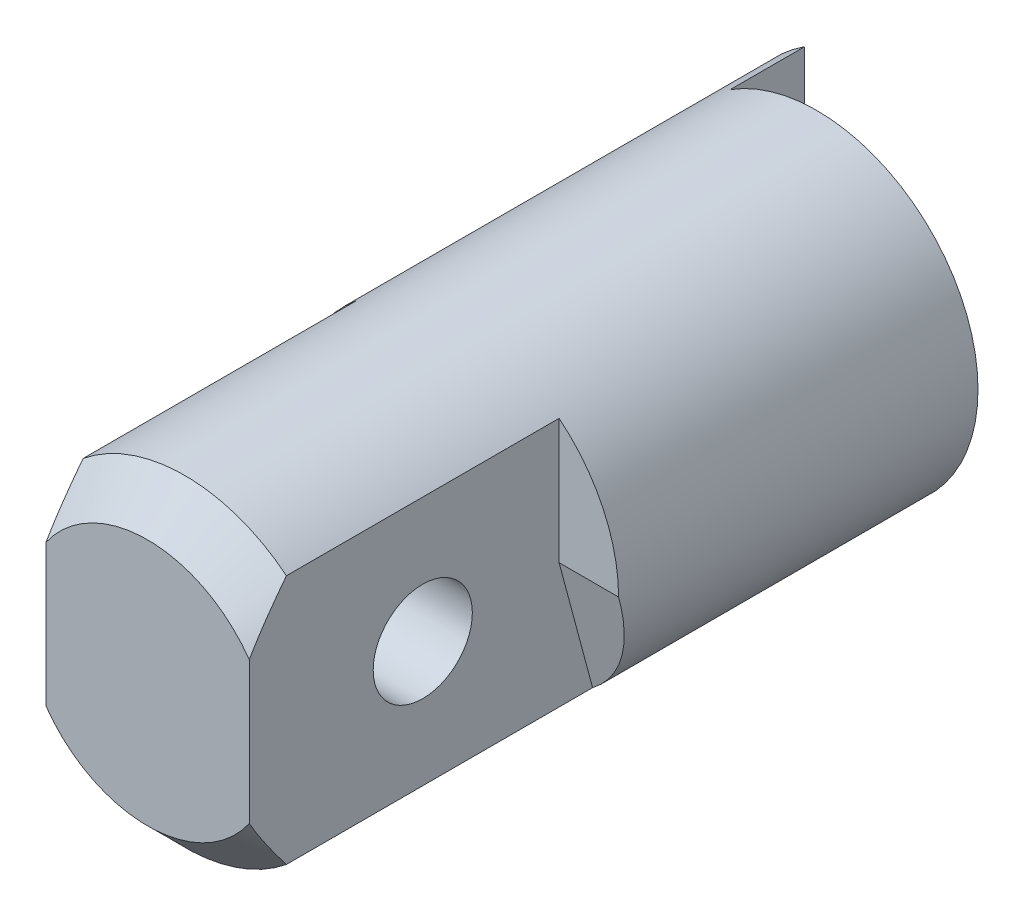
ISO-10303-21;
HEADER;
FILE_DESCRIPTION(('STEP AP214'),'2;1');
FILE_NAME('part.step','',(''),(''),'','','');
FILE_SCHEMA(('AUTOMOTIVE_DESIGN { 1 0 10303 214 1 1 1 1 }'));
ENDSEC;
DATA;
#1=APPLICATION_CONTEXT('core data for automotive mechanical design processes');
#2=APPLICATION_PROTOCOL_DEFINITION('international standard','automotive_design',2000,#1);
#3=PRODUCT_CONTEXT('',#1,'mechanical');
#4=PRODUCT('Part','Part','',(#3));
#5=PRODUCT_RELATED_PRODUCT_CATEGORY('part','',(#4));
#6=PRODUCT_DEFINITION_FORMATION('','',#4);
#7=PRODUCT_DEFINITION_CONTEXT('part definition',#1,'design');
#8=PRODUCT_DEFINITION('design','',#6,#7);
#9=PRODUCT_DEFINITION_SHAPE('','',#8);
#10=(LENGTH_UNIT() NAMED_UNIT(*) SI_UNIT(.MILLI.,.METRE.));
#11=(NAMED_UNIT(*) PLANE_ANGLE_UNIT() SI_UNIT($,.RADIAN.));
#12=(NAMED_UNIT(*) SI_UNIT($,.STERADIAN.) SOLID_ANGLE_UNIT());
#13=UNCERTAINTY_MEASURE_WITH_UNIT(LENGTH_MEASURE(1.E-05),#10,'distance_accuracy_value','');
#14=(GEOMETRIC_REPRESENTATION_CONTEXT(3) GLOBAL_UNCERTAINTY_ASSIGNED_CONTEXT((#13)) GLOBAL_UNIT_ASSIGNED_CONTEXT((#10,
#11,#12)) REPRESENTATION_CONTEXT('',''));
#15=CARTESIAN_POINT('',(0.,0.,0.));
#16=DIRECTION('',(0.,0.,1.));
#17=DIRECTION('',(1.,0.,0.));
#18=AXIS2_PLACEMENT_3D('',#15,#16,#17);
#19=CARTESIAN_POINT('',(0.,0.,-3.));
#20=DIRECTION('',(0.,0.,-1.));
#21=DIRECTION('',(-1.,0.,0.));
#22=AXIS2_PLACEMENT_3D('',#19,#20,#21);
#23=CYLINDRICAL_SURFACE('',#22,6.5);
#24=DIRECTION('',(0.,0.,-1.));
#25=VECTOR('',#24,1.);
#26=CARTESIAN_POINT('',(-4.1,5.0438080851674,-3.));
#27=LINE('',#26,#25);
#28=CARTESIAN_POINT('',(-4.1,5.0438080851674,14.5));
#29=VERTEX_POINT('',#28);
#30=CARTESIAN_POINT('',(-4.1,5.0438080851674,25.5));
#31=VERTEX_POINT('',#30);
#32=EDGE_CURVE('E145',#29,#31,#27,.F.);
#33=ORIENTED_EDGE('',*,*,#32,.T.);
#34=CARTESIAN_POINT('',(0.,0.,25.5));
#35=DIRECTION('',(0.,0.,-1.));
#36=DIRECTION('',(-1.,0.,0.));
#37=AXIS2_PLACEMENT_3D('',#34,#35,#36);
#38=CIRCLE('',#37,6.5);
#39=CARTESIAN_POINT('',(4.1,5.0438080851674,25.5));
#40=VERTEX_POINT('',#39);
#41=EDGE_CURVE('E176',#31,#40,#38,.T.);
#42=ORIENTED_EDGE('',*,*,#41,.T.);
#43=DIRECTION('',(0.,0.,-1.));
#44=VECTOR('',#43,1.);
#45=CARTESIAN_POINT('',(4.1,5.0438080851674,-3.));
#46=LINE('',#45,#44);
#47=CARTESIAN_POINT('',(4.1,5.0438080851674,14.5));
#48=VERTEX_POINT('',#47);
#49=EDGE_CURVE('E159',#40,#48,#46,.T.);
#50=ORIENTED_EDGE('',*,*,#49,.T.);
#51=CARTESIAN_POINT('',(0.,0.,14.5));
#52=DIRECTION('',(0.,0.,-1.));
#53=DIRECTION('',(-1.,0.,0.));
#54=AXIS2_PLACEMENT_3D('',#51,#52,#53);
#55=CIRCLE('',#54,6.5);
#56=CARTESIAN_POINT('',(6.5,0.,14.5));
#57=VERTEX_POINT('',#56);
#58=EDGE_CURVE('E164',#48,#57,#55,.T.);
#59=ORIENTED_EDGE('',*,*,#58,.T.);
#60=CARTESIAN_POINT('',(0.,0.,14.5));
#61=DIRECTION('',(0.,-0.258819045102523,0.965925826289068));
#62=DIRECTION('',(0.,-0.965925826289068,-0.258819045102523));
#63=AXIS2_PLACEMENT_3D('',#60,#61,#62);
#64=ELLIPSE('',#63,6.72929517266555,6.5);
#65=CARTESIAN_POINT('',(4.1,-5.0438080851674,13.1485156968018));
#66=VERTEX_POINT('',#65);
#67=EDGE_CURVE('E137',#66,#57,#64,.T.);
#68=ORIENTED_EDGE('',*,*,#67,.F.);
#69=DIRECTION('',(0.,0.,-1.));
#70=VECTOR('',#69,1.);
#71=CARTESIAN_POINT('',(4.1,-5.0438080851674,-3.));
#72=LINE('',#71,#70);
#73=CARTESIAN_POINT('',(4.1,-5.0438080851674,25.5));
#74=VERTEX_POINT('',#73);
#75=EDGE_CURVE('E156',#66,#74,#72,.F.);
#76=ORIENTED_EDGE('',*,*,#75,.T.);
#77=CARTESIAN_POINT('',(0.,0.,25.5));
#78=DIRECTION('',(0.,0.,-1.));
#79=DIRECTION('',(-1.,0.,0.));
#80=AXIS2_PLACEMENT_3D('',#77,#78,#79);
#81=CIRCLE('',#80,6.5);
#82=CARTESIAN_POINT('',(-4.1,-5.0438080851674,25.5));
#83=VERTEX_POINT('',#82);
#84=EDGE_CURVE('E173',#74,#83,#81,.T.);
#85=ORIENTED_EDGE('',*,*,#84,.T.);
#86=DIRECTION('',(0.,0.,-1.));
#87=VECTOR('',#86,1.);
#88=CARTESIAN_POINT('',(-4.1,-5.0438080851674,-3.));
#89=LINE('',#88,#87);
#90=CARTESIAN_POINT('',(-4.1,-5.0438080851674,13.1485156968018));
#91=VERTEX_POINT('',#90);
#92=EDGE_CURVE('E148',#83,#91,#89,.T.);
#93=ORIENTED_EDGE('',*,*,#92,.T.);
#94=CARTESIAN_POINT('',(0.,0.,14.5));
#95=DIRECTION('',(0.,-0.258819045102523,0.965925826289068));
#96=DIRECTION('',(0.,-0.965925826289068,-0.258819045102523));
#97=AXIS2_PLACEMENT_3D('',#94,#95,#96);
#98=ELLIPSE('',#97,6.72929517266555,6.5);
#99=CARTESIAN_POINT('',(-6.5,0.,14.5));
#100=VERTEX_POINT('',#99);
#101=EDGE_CURVE('E129',#100,#91,#98,.T.);
#102=ORIENTED_EDGE('',*,*,#101,.F.);
#103=CARTESIAN_POINT('',(0.,0.,14.5));
#104=DIRECTION('',(0.,0.,-1.));
#105=DIRECTION('',(-1.,0.,0.));
#106=AXIS2_PLACEMENT_3D('',#103,#104,#105);
#107=CIRCLE('',#106,6.5);
#108=EDGE_CURVE('E169',#100,#29,#107,.T.);
#109=ORIENTED_EDGE('',*,*,#108,.T.);
#110=EDGE_LOOP('',(#33,#42,#50,#59,#68,#76,#85,#93,#102,#109));
#111=FACE_BOUND('',#110,.T.);
#112=DIRECTION('',(0.,0.,-1.));
#113=VECTOR('',#112,1.);
#114=CARTESIAN_POINT('',(-3.5,-5.47722557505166,0.));
#115=LINE('',#114,#113);
#116=CARTESIAN_POINT('',(-3.5,-5.47722557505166,0.));
#117=VERTEX_POINT('',#116);
#118=CARTESIAN_POINT('',(-3.5,-5.47722557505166,-3.));
#119=VERTEX_POINT('',#118);
#120=EDGE_CURVE('E118',#117,#119,#115,.T.);
#121=ORIENTED_EDGE('',*,*,#120,.F.);
#122=CARTESIAN_POINT('',(0.,0.,0.));
#123=DIRECTION('',(0.,0.,-1.));
#124=DIRECTION('',(-1.,0.,0.));
#125=AXIS2_PLACEMENT_3D('',#122,#123,#124);
#126=CIRCLE('',#125,6.5);
#127=CARTESIAN_POINT('',(-3.5,5.47722557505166,0.));
#128=VERTEX_POINT('',#127);
#129=EDGE_CURVE('E113',#128,#117,#126,.T.);
#130=ORIENTED_EDGE('',*,*,#129,.F.);
#131=DIRECTION('',(0.,0.,-1.));
#132=VECTOR('',#131,1.);
#133=CARTESIAN_POINT('',(-3.5,5.47722557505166,0.));
#134=LINE('',#133,#132);
#135=CARTESIAN_POINT('',(-3.5,5.47722557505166,-3.));
#136=VERTEX_POINT('',#135);
#137=EDGE_CURVE('E119',#128,#136,#134,.T.);
#138=ORIENTED_EDGE('',*,*,#137,.T.);
#139=CARTESIAN_POINT('',(0.,0.,-3.));
#140=DIRECTION('',(0.,0.,-1.));
#141=DIRECTION('',(-1.,0.,0.));
#142=AXIS2_PLACEMENT_3D('',#139,#140,#141);
#143=CIRCLE('',#142,6.5);
#144=EDGE_CURVE('E161',#119,#136,#143,.T.);
#145=ORIENTED_EDGE('',*,*,#144,.F.);
#146=EDGE_LOOP('',(#121,#130,#138,#145));
#147=FACE_BOUND('',#146,.T.);
#148=ADVANCED_FACE('F14',(#111,#147),#23,.T.);
#149=CARTESIAN_POINT('',(6.5,0.,-3.));
#150=DIRECTION('',(0.,0.,1.));
#151=DIRECTION('',(1.,0.,0.));
#152=AXIS2_PLACEMENT_3D('',#149,#150,#151);
#153=PLANE('',#152);
#154=ORIENTED_EDGE('',*,*,#144,.T.);
#155=DIRECTION('',(0.,1.,0.));
#156=VECTOR('',#155,1.);
#157=CARTESIAN_POINT('',(-3.5,5.47722557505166,-3.));
#158=LINE('',#157,#156);
#159=EDGE_CURVE('E109',#119,#136,#158,.T.);
#160=ORIENTED_EDGE('',*,*,#159,.F.);
#161=EDGE_LOOP('',(#154,#160));
#162=FACE_BOUND('',#161,.T.);
#163=ADVANCED_FACE('F16',(#162),#153,.F.);
#164=CARTESIAN_POINT('',(-4.1,-10.,14.5));
#165=DIRECTION('',(0.,0.,-1.));
#166=DIRECTION('',(-1.,0.,0.));
#167=AXIS2_PLACEMENT_3D('',#164,#165,#166);
#168=PLANE('',#167);
#169=DIRECTION('',(1.,0.,0.));
#170=VECTOR('',#169,1.);
#171=CARTESIAN_POINT('',(-6.5,0.,14.5));
#172=LINE('',#171,#170);
#173=CARTESIAN_POINT('',(-4.1,0.,14.5));
#174=VERTEX_POINT('',#173);
#175=EDGE_CURVE('E126',#100,#174,#172,.T.);
#176=ORIENTED_EDGE('',*,*,#175,.T.);
#177=DIRECTION('',(0.,1.,0.));
#178=VECTOR('',#177,1.);
#179=CARTESIAN_POINT('',(-4.1,-10.,14.5));
#180=LINE('',#179,#178);
#181=EDGE_CURVE('E140',#174,#29,#180,.T.);
#182=ORIENTED_EDGE('',*,*,#181,.T.);
#183=ORIENTED_EDGE('',*,*,#108,.F.);
#184=EDGE_LOOP('',(#176,#182,#183));
#185=FACE_BOUND('',#184,.T.);
#186=ADVANCED_FACE('F210',(#185),#168,.F.);
#187=CARTESIAN_POINT('',(14.2470791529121,-10.,14.5));
#188=DIRECTION('',(0.,0.,-1.));
#189=DIRECTION('',(-1.,0.,0.));
#190=AXIS2_PLACEMENT_3D('',#187,#188,#189);
#191=PLANE('',#190);
#192=DIRECTION('',(-1.,0.,0.));
#193=VECTOR('',#192,1.);
#194=CARTESIAN_POINT('',(6.5,0.,14.5));
#195=LINE('',#194,#193);
#196=CARTESIAN_POINT('',(4.1,0.,14.5));
#197=VERTEX_POINT('',#196);
#198=EDGE_CURVE('E135',#57,#197,#195,.T.);
#199=ORIENTED_EDGE('',*,*,#198,.F.);
#200=ORIENTED_EDGE('',*,*,#58,.F.);
#201=DIRECTION('',(0.,1.,0.));
#202=VECTOR('',#201,1.);
#203=CARTESIAN_POINT('',(4.1,-10.,14.5));
#204=LINE('',#203,#202);
#205=EDGE_CURVE('E150',#197,#48,#204,.T.);
#206=ORIENTED_EDGE('',*,*,#205,.F.);
#207=EDGE_LOOP('',(#199,#200,#206));
#208=FACE_BOUND('',#207,.T.);
#209=ADVANCED_FACE('F205',(#208),#191,.F.);
#210=CARTESIAN_POINT('',(6.5,0.,27.));
#211=DIRECTION('',(0.,0.,-1.));
#212=DIRECTION('',(-1.,0.,0.));
#213=AXIS2_PLACEMENT_3D('',#210,#211,#212);
#214=PLANE('',#213);
#215=DIRECTION('',(0.,1.,0.));
#216=VECTOR('',#215,1.);
#217=CARTESIAN_POINT('',(4.1,-10.,27.));
#218=LINE('',#217,#216);
#219=CARTESIAN_POINT('',(4.1,-2.86181760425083,27.));
#220=VERTEX_POINT('',#219);
#221=CARTESIAN_POINT('',(4.1,2.86181760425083,27.));
#222=VERTEX_POINT('',#221);
#223=EDGE_CURVE('E151',#220,#222,#218,.T.);
#224=ORIENTED_EDGE('',*,*,#223,.T.);
#225=CARTESIAN_POINT('',(0.,0.,27.));
#226=DIRECTION('',(0.,0.,-1.));
#227=DIRECTION('',(-1.,0.,0.));
#228=AXIS2_PLACEMENT_3D('',#225,#226,#227);
#229=CIRCLE('',#228,5.);
#230=CARTESIAN_POINT('',(-4.1,2.86181760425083,27.));
#231=VERTEX_POINT('',#230);
#232=EDGE_CURVE('E35',#222,#231,#229,.F.);
#233=ORIENTED_EDGE('',*,*,#232,.T.);
#234=DIRECTION('',(0.,1.,0.));
#235=VECTOR('',#234,1.);
#236=CARTESIAN_POINT('',(-4.1,-10.,27.));
#237=LINE('',#236,#235);
#238=CARTESIAN_POINT('',(-4.1,-2.86181760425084,27.));
#239=VERTEX_POINT('',#238);
#240=EDGE_CURVE('E139',#239,#231,#237,.T.);
#241=ORIENTED_EDGE('',*,*,#240,.F.);
#242=CARTESIAN_POINT('',(0.,0.,27.));
#243=DIRECTION('',(0.,0.,-1.));
#244=DIRECTION('',(-1.,0.,0.));
#245=AXIS2_PLACEMENT_3D('',#242,#243,#244);
#246=CIRCLE('',#245,5.);
#247=EDGE_CURVE('E258',#239,#220,#246,.F.);
#248=ORIENTED_EDGE('',*,*,#247,.T.);
#249=EDGE_LOOP('',(#224,#233,#241,#248));
#250=FACE_BOUND('',#249,.T.);
#251=ADVANCED_FACE('F209',(#250),#214,.F.);
#252=CARTESIAN_POINT('',(-10.,0.,20.));
#253=DIRECTION('',(1.,0.,0.));
#254=DIRECTION('',(0.,0.,-1.));
#255=AXIS2_PLACEMENT_3D('',#252,#253,#254);
#256=CYLINDRICAL_SURFACE('',#255,2.);
#257=CARTESIAN_POINT('',(-4.1,0.,20.));
#258=DIRECTION('',(1.,0.,0.));
#259=DIRECTION('',(0.,0.,-1.));
#260=AXIS2_PLACEMENT_3D('',#257,#258,#259);
#261=CIRCLE('',#260,2.);
#262=CARTESIAN_POINT('',(-4.1,0.,18.));
#263=VERTEX_POINT('',#262);
#264=EDGE_CURVE('E143',#263,#263,#261,.F.);
#265=ORIENTED_EDGE('',*,*,#264,.T.);
#266=EDGE_LOOP('',(#265));
#267=FACE_BOUND('',#266,.T.);
#268=CARTESIAN_POINT('',(4.1,0.,20.));
#269=DIRECTION('',(-1.,0.,0.));
#270=DIRECTION('',(0.,0.,1.));
#271=AXIS2_PLACEMENT_3D('',#268,#269,#270);
#272=CIRCLE('',#271,2.);
#273=CARTESIAN_POINT('',(4.1,0.,22.));
#274=VERTEX_POINT('',#273);
#275=EDGE_CURVE('E153',#274,#274,#272,.F.);
#276=ORIENTED_EDGE('',*,*,#275,.T.);
#277=EDGE_LOOP('',(#276));
#278=FACE_BOUND('',#277,.T.);
#279=ADVANCED_FACE('F201',(#267,#278),#256,.F.);
#280=CARTESIAN_POINT('',(4.1,-10.,14.5));
#281=DIRECTION('',(-1.,0.,0.));
#282=DIRECTION('',(0.,0.,1.));
#283=AXIS2_PLACEMENT_3D('',#280,#281,#282);
#284=PLANE('',#283);
#285=ORIENTED_EDGE('',*,*,#275,.F.);
#286=EDGE_LOOP('',(#285));
#287=FACE_BOUND('',#286,.T.);
#288=ORIENTED_EDGE('',*,*,#49,.F.);
#289=CARTESIAN_POINT('',(4.1,5.0438080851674,25.5));
#290=CARTESIAN_POINT('',(4.1,4.95654758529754,25.5677086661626));
#291=CARTESIAN_POINT('',(4.1,4.86895267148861,25.6349843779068));
#292=CARTESIAN_POINT('',(4.1,4.69300619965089,25.7685455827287));
#293=CARTESIAN_POINT('',(4.1,4.60465461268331,25.8348310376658));
#294=CARTESIAN_POINT('',(4.1,4.33855611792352,26.0318501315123));
#295=CARTESIAN_POINT('',(4.1,4.15955657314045,26.1609095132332));
#296=CARTESIAN_POINT('',(4.1,3.8879115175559,26.3500749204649));
#297=CARTESIAN_POINT('',(4.1,3.79681450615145,26.4124085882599));
#298=CARTESIAN_POINT('',(4.1,3.61346203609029,26.5353428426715));
#299=CARTESIAN_POINT('',(4.1,3.52120663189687,26.5959435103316));
#300=CARTESIAN_POINT('',(4.1,3.33529470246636,26.7152019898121));
#301=CARTESIAN_POINT('',(4.1,3.24163669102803,26.773857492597));
#302=CARTESIAN_POINT('',(4.1,3.05285785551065,26.8887994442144));
#303=CARTESIAN_POINT('',(4.1,2.95773678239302,26.9450854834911));
#304=CARTESIAN_POINT('',(4.1,2.86181760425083,27.));
#305=B_SPLINE_CURVE_WITH_KNOTS('',3,(#289,#290,#291,#292,#293,#294,#295,#296,#297,#298,#299,
#300,#301,#302,#303,#304),.UNSPECIFIED.,.F.,.F.,(4,2,2,2,2,2,2,4),(0.,0.331340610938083,
0.662693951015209,1.32460586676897,1.65573602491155,1.98685067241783,2.31834524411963,
2.64989688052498),.UNSPECIFIED.);
#306=EDGE_CURVE('E187',#40,#222,#305,.T.);
#307=ORIENTED_EDGE('',*,*,#306,.T.);
#308=ORIENTED_EDGE('',*,*,#223,.F.);
#309=CARTESIAN_POINT('',(4.1,-2.86181760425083,27.));
#310=CARTESIAN_POINT('',(4.1,-2.95773678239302,26.9450854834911));
#311=CARTESIAN_POINT('',(4.1,-3.05285785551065,26.8887994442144));
#312=CARTESIAN_POINT('',(4.1,-3.24163669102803,26.773857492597));
#313=CARTESIAN_POINT('',(4.1,-3.33529470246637,26.7152019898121));
#314=CARTESIAN_POINT('',(4.1,-3.52120663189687,26.5959435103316));
#315=CARTESIAN_POINT('',(4.1,-3.61346203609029,26.5353428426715));
#316=CARTESIAN_POINT('',(4.1,-3.79681450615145,26.4124085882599));
#317=CARTESIAN_POINT('',(4.1,-3.8879115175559,26.3500749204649));
#318=CARTESIAN_POINT('',(4.1,-4.15955657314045,26.1609095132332));
#319=CARTESIAN_POINT('',(4.1,-4.33855611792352,26.0318501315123));
#320=CARTESIAN_POINT('',(4.1,-4.60465461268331,25.8348310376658));
#321=CARTESIAN_POINT('',(4.1,-4.69300619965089,25.7685455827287));
#322=CARTESIAN_POINT('',(4.1,-4.86895267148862,25.6349843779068));
#323=CARTESIAN_POINT('',(4.1,-4.95654758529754,25.5677086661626));
#324=CARTESIAN_POINT('',(4.1,-5.0438080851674,25.5));
#325=B_SPLINE_CURVE_WITH_KNOTS('',3,(#309,#310,#311,#312,#313,#314,#315,#316,#317,#318,#319,
#320,#321,#322,#323,#324),.UNSPECIFIED.,.F.,.F.,(4,2,2,2,2,2,2,4),(0.,0.331551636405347,
0.663046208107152,0.994160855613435,1.32529101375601,1.98720292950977,2.3185562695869,
2.64989688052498),.UNSPECIFIED.);
#326=EDGE_CURVE('E179',#220,#74,#325,.T.);
#327=ORIENTED_EDGE('',*,*,#326,.T.);
#328=ORIENTED_EDGE('',*,*,#75,.F.);
#329=DIRECTION('',(0.,0.965925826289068,0.258819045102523));
#330=VECTOR('',#329,1.);
#331=CARTESIAN_POINT('',(4.1,0.,14.5));
#332=LINE('',#331,#330);
#333=EDGE_CURVE('E132',#66,#197,#332,.T.);
#334=ORIENTED_EDGE('',*,*,#333,.T.);
#335=ORIENTED_EDGE('',*,*,#205,.T.);
#336=EDGE_LOOP('',(#288,#307,#308,#327,#328,#334,#335));
#337=FACE_BOUND('',#336,.T.);
#338=ADVANCED_FACE('F196',(#287,#337),#284,.F.);
#339=CARTESIAN_POINT('',(-4.1,-10.,14.5));
#340=DIRECTION('',(1.,0.,0.));
#341=DIRECTION('',(0.,0.,-1.));
#342=AXIS2_PLACEMENT_3D('',#339,#340,#341);
#343=PLANE('',#342);
#344=ORIENTED_EDGE('',*,*,#264,.F.);
#345=EDGE_LOOP('',(#344));
#346=FACE_BOUND('',#345,.T.);
#347=ORIENTED_EDGE('',*,*,#240,.T.);
#348=CARTESIAN_POINT('',(-4.1,2.86181760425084,27.));
#349=CARTESIAN_POINT('',(-4.1,2.95773678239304,26.9450854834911));
#350=CARTESIAN_POINT('',(-4.1,3.05285785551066,26.8887994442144));
#351=CARTESIAN_POINT('',(-4.1,3.24163669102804,26.7738574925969));
#352=CARTESIAN_POINT('',(-4.1,3.33529470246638,26.7152019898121));
#353=CARTESIAN_POINT('',(-4.1,3.52120663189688,26.5959435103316));
#354=CARTESIAN_POINT('',(-4.1,3.6134620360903,26.5353428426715));
#355=CARTESIAN_POINT('',(-4.1,3.79681450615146,26.4124085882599));
#356=CARTESIAN_POINT('',(-4.1,3.8879115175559,26.3500749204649));
#357=CARTESIAN_POINT('',(-4.1,4.15955657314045,26.1609095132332));
#358=CARTESIAN_POINT('',(-4.1,4.33855611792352,26.0318501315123));
#359=CARTESIAN_POINT('',(-4.1,4.60465461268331,25.8348310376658));
#360=CARTESIAN_POINT('',(-4.1,4.69300619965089,25.7685455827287));
#361=CARTESIAN_POINT('',(-4.1,4.86895267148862,25.6349843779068));
#362=CARTESIAN_POINT('',(-4.1,4.95654758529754,25.5677086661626));
#363=CARTESIAN_POINT('',(-4.1,5.0438080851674,25.5));
#364=B_SPLINE_CURVE_WITH_KNOTS('',3,(#348,#349,#350,#351,#352,#353,#354,#355,#356,#357,#358,
#359,#360,#361,#362,#363),.UNSPECIFIED.,.F.,.F.,(4,2,2,2,2,2,2,4),(0.,0.331551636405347,
0.663046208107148,0.994160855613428,1.325291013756,1.98720292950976,2.31855626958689,
2.64989688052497),.UNSPECIFIED.);
#365=EDGE_CURVE('E9',#231,#31,#364,.T.);
#366=ORIENTED_EDGE('',*,*,#365,.T.);
#367=ORIENTED_EDGE('',*,*,#32,.F.);
#368=ORIENTED_EDGE('',*,*,#181,.F.);
#369=DIRECTION('',(0.,-0.965925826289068,-0.258819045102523));
#370=VECTOR('',#369,1.);
#371=CARTESIAN_POINT('',(-4.1,0.,14.5));
#372=LINE('',#371,#370);
#373=EDGE_CURVE('E122',#174,#91,#372,.T.);
#374=ORIENTED_EDGE('',*,*,#373,.T.);
#375=ORIENTED_EDGE('',*,*,#92,.F.);
#376=CARTESIAN_POINT('',(-4.1,-5.0438080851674,25.5));
#377=CARTESIAN_POINT('',(-4.1,-4.95654758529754,25.5677086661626));
#378=CARTESIAN_POINT('',(-4.1,-4.86895267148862,25.6349843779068));
#379=CARTESIAN_POINT('',(-4.1,-4.69300619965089,25.7685455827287));
#380=CARTESIAN_POINT('',(-4.1,-4.60465461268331,25.8348310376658));
#381=CARTESIAN_POINT('',(-4.1,-4.33855611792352,26.0318501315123));
#382=CARTESIAN_POINT('',(-4.1,-4.15955657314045,26.1609095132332));
#383=CARTESIAN_POINT('',(-4.1,-3.8879115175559,26.3500749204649));
#384=CARTESIAN_POINT('',(-4.1,-3.79681450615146,26.4124085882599));
#385=CARTESIAN_POINT('',(-4.1,-3.6134620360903,26.5353428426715));
#386=CARTESIAN_POINT('',(-4.1,-3.52120663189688,26.5959435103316));
#387=CARTESIAN_POINT('',(-4.1,-3.33529470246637,26.7152019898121));
#388=CARTESIAN_POINT('',(-4.1,-3.24163669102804,26.773857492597));
#389=CARTESIAN_POINT('',(-4.1,-3.05285785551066,26.8887994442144));
#390=CARTESIAN_POINT('',(-4.1,-2.95773678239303,26.9450854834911));
#391=CARTESIAN_POINT('',(-4.1,-2.86181760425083,27.));
#392=B_SPLINE_CURVE_WITH_KNOTS('',3,(#376,#377,#378,#379,#380,#381,#382,#383,#384,#385,#386,
#387,#388,#389,#390,#391),.UNSPECIFIED.,.F.,.F.,(4,2,2,2,2,2,2,4),(0.,0.331340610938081,
0.662693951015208,1.32460586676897,1.65573602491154,1.98685067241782,2.31834524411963,
2.64989688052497),.UNSPECIFIED.);
#393=EDGE_CURVE('E28',#83,#239,#392,.T.);
#394=ORIENTED_EDGE('',*,*,#393,.T.);
#395=EDGE_LOOP('',(#347,#366,#367,#368,#374,#375,#394));
#396=FACE_BOUND('',#395,.T.);
#397=ADVANCED_FACE('F200',(#346,#396),#343,.F.);
#398=CARTESIAN_POINT('',(6.5,0.,14.5));
#399=DIRECTION('',(0.,-0.258819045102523,0.965925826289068));
#400=DIRECTION('',(0.,-0.965925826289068,-0.258819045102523));
#401=AXIS2_PLACEMENT_3D('',#398,#399,#400);
#402=PLANE('',#401);
#403=ORIENTED_EDGE('',*,*,#67,.T.);
#404=ORIENTED_EDGE('',*,*,#198,.T.);
#405=ORIENTED_EDGE('',*,*,#333,.F.);
#406=EDGE_LOOP('',(#403,#404,#405));
#407=FACE_BOUND('',#406,.T.);
#408=ADVANCED_FACE('F267',(#407),#402,.T.);
#409=CARTESIAN_POINT('',(-6.5,0.,14.5));
#410=DIRECTION('',(0.,-0.258819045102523,0.965925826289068));
#411=DIRECTION('',(0.,-0.965925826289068,-0.258819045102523));
#412=AXIS2_PLACEMENT_3D('',#409,#410,#411);
#413=PLANE('',#412);
#414=ORIENTED_EDGE('',*,*,#101,.T.);
#415=ORIENTED_EDGE('',*,*,#373,.F.);
#416=ORIENTED_EDGE('',*,*,#175,.F.);
#417=EDGE_LOOP('',(#414,#415,#416));
#418=FACE_BOUND('',#417,.T.);
#419=ADVANCED_FACE('F253',(#418),#413,.T.);
#420=CARTESIAN_POINT('',(0.,0.,25.5));
#421=DIRECTION('',(0.,0.,-1.));
#422=DIRECTION('',(-1.,0.,0.));
#423=AXIS2_PLACEMENT_3D('',#420,#421,#422);
#424=CONICAL_SURFACE('',#423,6.5,0.785398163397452);
#425=ORIENTED_EDGE('',*,*,#365,.F.);
#426=ORIENTED_EDGE('',*,*,#232,.F.);
#427=ORIENTED_EDGE('',*,*,#306,.F.);
#428=ORIENTED_EDGE('',*,*,#41,.F.);
#429=EDGE_LOOP('',(#425,#426,#427,#428));
#430=FACE_BOUND('',#429,.T.);
#431=ADVANCED_FACE('F248',(#430),#424,.T.);
#432=CARTESIAN_POINT('',(0.,0.,25.5));
#433=DIRECTION('',(0.,0.,-1.));
#434=DIRECTION('',(-1.,0.,0.));
#435=AXIS2_PLACEMENT_3D('',#432,#433,#434);
#436=CONICAL_SURFACE('',#435,6.5,0.785398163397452);
#437=ORIENTED_EDGE('',*,*,#326,.F.);
#438=ORIENTED_EDGE('',*,*,#247,.F.);
#439=ORIENTED_EDGE('',*,*,#393,.F.);
#440=ORIENTED_EDGE('',*,*,#84,.F.);
#441=EDGE_LOOP('',(#437,#438,#439,#440));
#442=FACE_BOUND('',#441,.T.);
#443=ADVANCED_FACE('F193',(#442),#436,.T.);
#444=CARTESIAN_POINT('',(-3.5,5.47722557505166,0.));
#445=DIRECTION('',(-1.,0.,0.));
#446=DIRECTION('',(0.,0.,1.));
#447=AXIS2_PLACEMENT_3D('',#444,#445,#446);
#448=PLANE('',#447);
#449=ORIENTED_EDGE('',*,*,#159,.T.);
#450=ORIENTED_EDGE('',*,*,#137,.F.);
#451=DIRECTION('',(0.,1.,0.));
#452=VECTOR('',#451,1.);
#453=CARTESIAN_POINT('',(-3.5,5.47722557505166,0.));
#454=LINE('',#453,#452);
#455=EDGE_CURVE('E115',#117,#128,#454,.T.);
#456=ORIENTED_EDGE('',*,*,#455,.F.);
#457=ORIENTED_EDGE('',*,*,#120,.T.);
#458=EDGE_LOOP('',(#449,#450,#456,#457));
#459=FACE_BOUND('',#458,.T.);
#460=ADVANCED_FACE('F232',(#459),#448,.F.);
#461=CARTESIAN_POINT('',(0.,0.,0.));
#462=DIRECTION('',(0.,0.,-1.));
#463=DIRECTION('',(-1.,0.,0.));
#464=AXIS2_PLACEMENT_3D('',#461,#462,#463);
#465=PLANE('',#464);
#466=ORIENTED_EDGE('',*,*,#129,.T.);
#467=ORIENTED_EDGE('',*,*,#455,.T.);
#468=EDGE_LOOP('',(#466,#467));
#469=FACE_BOUND('',#468,.T.);
#470=CARTESIAN_POINT('',(0.,0.,0.));
#471=DIRECTION('',(0.,0.,-1.));
#472=DIRECTION('',(-1.,0.,0.));
#473=AXIS2_PLACEMENT_3D('',#470,#471,#472);
#474=CIRCLE('',#473,3.);
#475=CARTESIAN_POINT('',(-3.,0.,0.));
#476=VERTEX_POINT('',#475);
#477=EDGE_CURVE('E106',#476,#476,#474,.T.);
#478=ORIENTED_EDGE('',*,*,#477,.F.);
#479=EDGE_LOOP('',(#478));
#480=FACE_BOUND('',#479,.T.);
#481=ADVANCED_FACE('F234',(#469,#480),#465,.T.);
#482=CARTESIAN_POINT('',(0.,0.,0.));
#483=DIRECTION('',(0.,0.,-1.));
#484=DIRECTION('',(-1.,0.,0.));
#485=AXIS2_PLACEMENT_3D('',#482,#483,#484);
#486=CYLINDRICAL_SURFACE('',#485,3.);
#487=CARTESIAN_POINT('',(0.,0.,11.));
#488=DIRECTION('',(0.,0.,-1.));
#489=DIRECTION('',(-1.,0.,0.));
#490=AXIS2_PLACEMENT_3D('',#487,#488,#489);
#491=CIRCLE('',#490,3.);
#492=CARTESIAN_POINT('',(-3.,0.,11.));
#493=VERTEX_POINT('',#492);
#494=EDGE_CURVE('E104',#493,#493,#491,.T.);
#495=ORIENTED_EDGE('',*,*,#494,.F.);
#496=EDGE_LOOP('',(#495));
#497=FACE_BOUND('',#496,.T.);
#498=ORIENTED_EDGE('',*,*,#477,.T.);
#499=EDGE_LOOP('',(#498));
#500=FACE_BOUND('',#499,.T.);
#501=ADVANCED_FACE('F100',(#497,#500),#486,.F.);
#502=CARTESIAN_POINT('',(0.,0.,11.));
#503=DIRECTION('',(0.,0.,-1.));
#504=DIRECTION('',(-1.,0.,0.));
#505=AXIS2_PLACEMENT_3D('',#502,#503,#504);
#506=CONICAL_SURFACE('',#505,3.,1.02974425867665);
#507=CARTESIAN_POINT('',(0.,0.,12.8025818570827));
#508=VERTEX_POINT('',#507);
#509=VERTEX_LOOP('',#508);
#510=FACE_BOUND('',#509,.T.);
#511=ORIENTED_EDGE('',*,*,#494,.T.);
#512=EDGE_LOOP('',(#511));
#513=FACE_BOUND('',#512,.T.);
#514=ADVANCED_FACE('F97',(#510,#513),#506,.F.);
#515=CLOSED_SHELL('',(#148,#163,#186,#209,#251,#279,#338,#397,#408,#419,#431,#443,#460,#481,
#501,#514));
#516=MANIFOLD_SOLID_BREP('B1',#515);
#517=ADVANCED_BREP_SHAPE_REPRESENTATION('',(#18,#516),#14);
#518=SHAPE_DEFINITION_REPRESENTATION(#9,#517);
ENDSEC;
END-ISO-10303-21;
